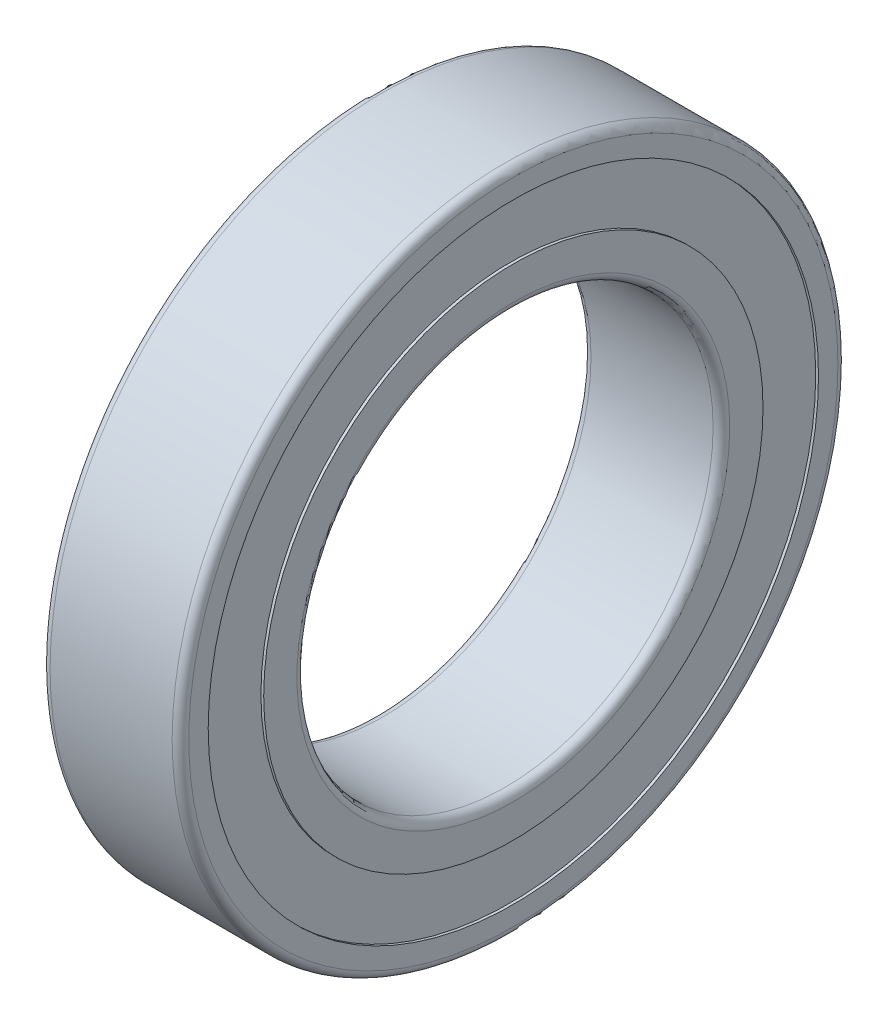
ISO-10303-21;
HEADER;
FILE_DESCRIPTION(('STEP AP214'),'2;1');
FILE_NAME('part.step','',(''),(''),'','','');
FILE_SCHEMA(('AUTOMOTIVE_DESIGN { 1 0 10303 214 1 1 1 1 }'));
ENDSEC;
DATA;
#1=APPLICATION_CONTEXT('core data for automotive mechanical design processes');
#2=APPLICATION_PROTOCOL_DEFINITION('international standard','automotive_design',2000,#1);
#3=PRODUCT_CONTEXT('',#1,'mechanical');
#4=PRODUCT('Part','Part','',(#3));
#5=PRODUCT_RELATED_PRODUCT_CATEGORY('part','',(#4));
#6=PRODUCT_DEFINITION_FORMATION('','',#4);
#7=PRODUCT_DEFINITION_CONTEXT('part definition',#1,'design');
#8=PRODUCT_DEFINITION('design','',#6,#7);
#9=PRODUCT_DEFINITION_SHAPE('','',#8);
#10=(LENGTH_UNIT() NAMED_UNIT(*) SI_UNIT(.MILLI.,.METRE.));
#11=(NAMED_UNIT(*) PLANE_ANGLE_UNIT() SI_UNIT($,.RADIAN.));
#12=(NAMED_UNIT(*) SI_UNIT($,.STERADIAN.) SOLID_ANGLE_UNIT());
#13=UNCERTAINTY_MEASURE_WITH_UNIT(LENGTH_MEASURE(1.E-05),#10,'distance_accuracy_value','');
#14=(GEOMETRIC_REPRESENTATION_CONTEXT(3) GLOBAL_UNCERTAINTY_ASSIGNED_CONTEXT((#13)) GLOBAL_UNIT_ASSIGNED_CONTEXT((#10,
#11,#12)) REPRESENTATION_CONTEXT('',''));
#15=CARTESIAN_POINT('',(0.,0.,0.));
#16=DIRECTION('',(0.,0.,1.));
#17=DIRECTION('',(1.,0.,0.));
#18=AXIS2_PLACEMENT_3D('',#15,#16,#17);
#19=CARTESIAN_POINT('',(-2.2,0.,0.));
#20=DIRECTION('',(1.,0.,0.));
#21=DIRECTION('',(0.,0.,-1.));
#22=AXIS2_PLACEMENT_3D('',#19,#20,#21);
#23=TOROIDAL_SURFACE('',#22,11.7,0.3);
#24=CARTESIAN_POINT('',(-2.2,0.,0.));
#25=DIRECTION('',(1.,0.,0.));
#26=DIRECTION('',(0.,0.,-1.));
#27=AXIS2_PLACEMENT_3D('',#24,#25,#26);
#28=CIRCLE('',#27,12.);
#29=CARTESIAN_POINT('',(-2.2,0.,-12.));
#30=VERTEX_POINT('',#29);
#31=EDGE_CURVE('E40',#30,#30,#28,.T.);
#32=ORIENTED_EDGE('',*,*,#31,.F.);
#33=EDGE_LOOP('',(#32));
#34=FACE_BOUND('',#33,.T.);
#35=CARTESIAN_POINT('',(-2.5,0.,0.));
#36=DIRECTION('',(1.,0.,0.));
#37=DIRECTION('',(0.,0.,-1.));
#38=AXIS2_PLACEMENT_3D('',#35,#36,#37);
#39=CIRCLE('',#38,11.7);
#40=CARTESIAN_POINT('',(-2.5,0.,-11.7));
#41=VERTEX_POINT('',#40);
#42=EDGE_CURVE('E11',#41,#41,#39,.T.);
#43=ORIENTED_EDGE('',*,*,#42,.T.);
#44=EDGE_LOOP('',(#43));
#45=FACE_BOUND('',#44,.T.);
#46=ADVANCED_FACE('F17',(#34,#45),#23,.T.);
#47=CARTESIAN_POINT('',(-2.5,11.7,0.));
#48=DIRECTION('',(-1.,0.,0.));
#49=DIRECTION('',(0.,0.,1.));
#50=AXIS2_PLACEMENT_3D('',#47,#48,#49);
#51=PLANE('',#50);
#52=ORIENTED_EDGE('',*,*,#42,.F.);
#53=EDGE_LOOP('',(#52));
#54=FACE_BOUND('',#53,.T.);
#55=CARTESIAN_POINT('',(-2.5,0.,0.));
#56=DIRECTION('',(1.,0.,0.));
#57=DIRECTION('',(0.,0.,-1.));
#58=AXIS2_PLACEMENT_3D('',#55,#56,#57);
#59=CIRCLE('',#58,11.);
#60=CARTESIAN_POINT('',(-2.5,0.,-11.));
#61=VERTEX_POINT('',#60);
#62=EDGE_CURVE('E28',#61,#61,#59,.T.);
#63=ORIENTED_EDGE('',*,*,#62,.T.);
#64=EDGE_LOOP('',(#63));
#65=FACE_BOUND('',#64,.T.);
#66=ADVANCED_FACE('F176',(#54,#65),#51,.T.);
#67=CARTESIAN_POINT('',(2.5,0.,0.));
#68=DIRECTION('',(-1.,0.,0.));
#69=DIRECTION('',(0.,0.,-1.));
#70=AXIS2_PLACEMENT_3D('',#67,#68,#69);
#71=CYLINDRICAL_SURFACE('',#70,11.);
#72=ORIENTED_EDGE('',*,*,#62,.F.);
#73=EDGE_LOOP('',(#72));
#74=FACE_BOUND('',#73,.T.);
#75=CARTESIAN_POINT('',(-2.4,0.,0.));
#76=DIRECTION('',(1.,0.,0.));
#77=DIRECTION('',(0.,0.,-1.));
#78=AXIS2_PLACEMENT_3D('',#75,#76,#77);
#79=CIRCLE('',#78,11.);
#80=CARTESIAN_POINT('',(-2.4,0.,-11.));
#81=VERTEX_POINT('',#80);
#82=EDGE_CURVE('E97',#81,#81,#79,.T.);
#83=ORIENTED_EDGE('',*,*,#82,.T.);
#84=EDGE_LOOP('',(#83));
#85=FACE_BOUND('',#84,.T.);
#86=ADVANCED_FACE('F181',(#74,#85),#71,.F.);
#87=CARTESIAN_POINT('',(-2.4,11.,0.));
#88=DIRECTION('',(-1.,0.,0.));
#89=DIRECTION('',(0.,0.,1.));
#90=AXIS2_PLACEMENT_3D('',#87,#88,#89);
#91=PLANE('',#90);
#92=ORIENTED_EDGE('',*,*,#82,.F.);
#93=EDGE_LOOP('',(#92));
#94=FACE_BOUND('',#93,.T.);
#95=CARTESIAN_POINT('',(-2.4,0.,0.));
#96=DIRECTION('',(1.,0.,0.));
#97=DIRECTION('',(0.,0.,-1.));
#98=AXIS2_PLACEMENT_3D('',#95,#96,#97);
#99=CIRCLE('',#98,9.);
#100=CARTESIAN_POINT('',(-2.4,0.,-9.));
#101=VERTEX_POINT('',#100);
#102=EDGE_CURVE('E102',#101,#101,#99,.T.);
#103=ORIENTED_EDGE('',*,*,#102,.T.);
#104=EDGE_LOOP('',(#103));
#105=FACE_BOUND('',#104,.T.);
#106=ADVANCED_FACE('F98',(#94,#105),#91,.T.);
#107=CARTESIAN_POINT('',(2.5,0.,0.));
#108=DIRECTION('',(-1.,0.,0.));
#109=DIRECTION('',(0.,0.,-1.));
#110=AXIS2_PLACEMENT_3D('',#107,#108,#109);
#111=CYLINDRICAL_SURFACE('',#110,9.);
#112=ORIENTED_EDGE('',*,*,#102,.F.);
#113=EDGE_LOOP('',(#112));
#114=FACE_BOUND('',#113,.T.);
#115=CARTESIAN_POINT('',(-2.5,0.,0.));
#116=DIRECTION('',(1.,0.,0.));
#117=DIRECTION('',(0.,0.,-1.));
#118=AXIS2_PLACEMENT_3D('',#115,#116,#117);
#119=CIRCLE('',#118,9.);
#120=CARTESIAN_POINT('',(-2.5,0.,-9.));
#121=VERTEX_POINT('',#120);
#122=EDGE_CURVE('E111',#121,#121,#119,.T.);
#123=ORIENTED_EDGE('',*,*,#122,.T.);
#124=EDGE_LOOP('',(#123));
#125=FACE_BOUND('',#124,.T.);
#126=ADVANCED_FACE('F186',(#114,#125),#111,.T.);
#127=CARTESIAN_POINT('',(-2.5,9.,0.));
#128=DIRECTION('',(-1.,0.,0.));
#129=DIRECTION('',(0.,0.,1.));
#130=AXIS2_PLACEMENT_3D('',#127,#128,#129);
#131=PLANE('',#130);
#132=ORIENTED_EDGE('',*,*,#122,.F.);
#133=EDGE_LOOP('',(#132));
#134=FACE_BOUND('',#133,.T.);
#135=CARTESIAN_POINT('',(-2.5,0.,0.));
#136=DIRECTION('',(1.,0.,0.));
#137=DIRECTION('',(0.,0.,-1.));
#138=AXIS2_PLACEMENT_3D('',#135,#136,#137);
#139=CIRCLE('',#138,7.8);
#140=CARTESIAN_POINT('',(-2.5,0.,-7.8));
#141=VERTEX_POINT('',#140);
#142=EDGE_CURVE('E125',#141,#141,#139,.T.);
#143=ORIENTED_EDGE('',*,*,#142,.T.);
#144=EDGE_LOOP('',(#143));
#145=FACE_BOUND('',#144,.T.);
#146=ADVANCED_FACE('F198',(#134,#145),#131,.T.);
#147=CARTESIAN_POINT('',(-2.2,0.,0.));
#148=DIRECTION('',(1.,0.,0.));
#149=DIRECTION('',(0.,0.,-1.));
#150=AXIS2_PLACEMENT_3D('',#147,#148,#149);
#151=TOROIDAL_SURFACE('',#150,7.8,0.3);
#152=ORIENTED_EDGE('',*,*,#142,.F.);
#153=EDGE_LOOP('',(#152));
#154=FACE_BOUND('',#153,.T.);
#155=CARTESIAN_POINT('',(-2.2,0.,0.));
#156=DIRECTION('',(1.,0.,0.));
#157=DIRECTION('',(0.,0.,-1.));
#158=AXIS2_PLACEMENT_3D('',#155,#156,#157);
#159=CIRCLE('',#158,7.5);
#160=CARTESIAN_POINT('',(-2.2,0.,-7.5));
#161=VERTEX_POINT('',#160);
#162=EDGE_CURVE('E122',#161,#161,#159,.T.);
#163=ORIENTED_EDGE('',*,*,#162,.T.);
#164=EDGE_LOOP('',(#163));
#165=FACE_BOUND('',#164,.T.);
#166=ADVANCED_FACE('F19',(#154,#165),#151,.T.);
#167=CARTESIAN_POINT('',(2.5,0.,0.));
#168=DIRECTION('',(-1.,0.,0.));
#169=DIRECTION('',(0.,0.,-1.));
#170=AXIS2_PLACEMENT_3D('',#167,#168,#169);
#171=CYLINDRICAL_SURFACE('',#170,7.5);
#172=ORIENTED_EDGE('',*,*,#162,.F.);
#173=EDGE_LOOP('',(#172));
#174=FACE_BOUND('',#173,.T.);
#175=CARTESIAN_POINT('',(2.2,0.,0.));
#176=DIRECTION('',(1.,0.,0.));
#177=DIRECTION('',(0.,0.,-1.));
#178=AXIS2_PLACEMENT_3D('',#175,#176,#177);
#179=CIRCLE('',#178,7.5);
#180=CARTESIAN_POINT('',(2.2,0.,-7.5));
#181=VERTEX_POINT('',#180);
#182=EDGE_CURVE('E117',#181,#181,#179,.T.);
#183=ORIENTED_EDGE('',*,*,#182,.T.);
#184=EDGE_LOOP('',(#183));
#185=FACE_BOUND('',#184,.T.);
#186=ADVANCED_FACE('F216',(#174,#185),#171,.F.);
#187=CARTESIAN_POINT('',(2.2,0.,0.));
#188=DIRECTION('',(1.,0.,0.));
#189=DIRECTION('',(0.,0.,-1.));
#190=AXIS2_PLACEMENT_3D('',#187,#188,#189);
#191=TOROIDAL_SURFACE('',#190,7.8,0.3);
#192=ORIENTED_EDGE('',*,*,#182,.F.);
#193=EDGE_LOOP('',(#192));
#194=FACE_BOUND('',#193,.T.);
#195=CARTESIAN_POINT('',(2.5,0.,0.));
#196=DIRECTION('',(1.,0.,0.));
#197=DIRECTION('',(0.,0.,-1.));
#198=AXIS2_PLACEMENT_3D('',#195,#196,#197);
#199=CIRCLE('',#198,7.80000000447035);
#200=CARTESIAN_POINT('',(2.5,0.,-7.80000000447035));
#201=VERTEX_POINT('',#200);
#202=EDGE_CURVE('E114',#201,#201,#199,.T.);
#203=ORIENTED_EDGE('',*,*,#202,.T.);
#204=EDGE_LOOP('',(#203));
#205=FACE_BOUND('',#204,.T.);
#206=ADVANCED_FACE('F209',(#194,#205),#191,.T.);
#207=CARTESIAN_POINT('',(2.5,7.8,0.));
#208=DIRECTION('',(1.,0.,0.));
#209=DIRECTION('',(0.,1.,0.));
#210=AXIS2_PLACEMENT_3D('',#207,#208,#209);
#211=PLANE('',#210);
#212=CARTESIAN_POINT('',(2.5,0.,0.));
#213=DIRECTION('',(1.,0.,0.));
#214=DIRECTION('',(0.,0.,-1.));
#215=AXIS2_PLACEMENT_3D('',#212,#213,#214);
#216=CIRCLE('',#215,9.);
#217=CARTESIAN_POINT('',(2.5,0.,-9.));
#218=VERTEX_POINT('',#217);
#219=EDGE_CURVE('E118',#218,#218,#216,.T.);
#220=ORIENTED_EDGE('',*,*,#219,.T.);
#221=EDGE_LOOP('',(#220));
#222=FACE_BOUND('',#221,.T.);
#223=ORIENTED_EDGE('',*,*,#202,.F.);
#224=EDGE_LOOP('',(#223));
#225=FACE_BOUND('',#224,.T.);
#226=ADVANCED_FACE('F205',(#222,#225),#211,.T.);
#227=CARTESIAN_POINT('',(2.5,0.,0.));
#228=DIRECTION('',(-1.,0.,0.));
#229=DIRECTION('',(0.,0.,-1.));
#230=AXIS2_PLACEMENT_3D('',#227,#228,#229);
#231=CYLINDRICAL_SURFACE('',#230,9.);
#232=ORIENTED_EDGE('',*,*,#219,.F.);
#233=EDGE_LOOP('',(#232));
#234=FACE_BOUND('',#233,.T.);
#235=CARTESIAN_POINT('',(2.4,0.,0.));
#236=DIRECTION('',(1.,0.,0.));
#237=DIRECTION('',(0.,0.,-1.));
#238=AXIS2_PLACEMENT_3D('',#235,#236,#237);
#239=CIRCLE('',#238,9.);
#240=CARTESIAN_POINT('',(2.4,0.,-9.));
#241=VERTEX_POINT('',#240);
#242=EDGE_CURVE('E119',#241,#241,#239,.T.);
#243=ORIENTED_EDGE('',*,*,#242,.T.);
#244=EDGE_LOOP('',(#243));
#245=FACE_BOUND('',#244,.T.);
#246=ADVANCED_FACE('F202',(#234,#245),#231,.T.);
#247=CARTESIAN_POINT('',(2.4,9.,0.));
#248=DIRECTION('',(1.,0.,0.));
#249=DIRECTION('',(0.,1.,0.));
#250=AXIS2_PLACEMENT_3D('',#247,#248,#249);
#251=PLANE('',#250);
#252=CARTESIAN_POINT('',(2.4,0.,0.));
#253=DIRECTION('',(1.,0.,0.));
#254=DIRECTION('',(0.,0.,-1.));
#255=AXIS2_PLACEMENT_3D('',#252,#253,#254);
#256=CIRCLE('',#255,11.);
#257=CARTESIAN_POINT('',(2.4,0.,-11.));
#258=VERTEX_POINT('',#257);
#259=EDGE_CURVE('E21',#258,#258,#256,.T.);
#260=ORIENTED_EDGE('',*,*,#259,.T.);
#261=EDGE_LOOP('',(#260));
#262=FACE_BOUND('',#261,.T.);
#263=ORIENTED_EDGE('',*,*,#242,.F.);
#264=EDGE_LOOP('',(#263));
#265=FACE_BOUND('',#264,.T.);
#266=ADVANCED_FACE('F194',(#262,#265),#251,.T.);
#267=CARTESIAN_POINT('',(2.5,0.,0.));
#268=DIRECTION('',(-1.,0.,0.));
#269=DIRECTION('',(0.,0.,-1.));
#270=AXIS2_PLACEMENT_3D('',#267,#268,#269);
#271=CYLINDRICAL_SURFACE('',#270,11.);
#272=ORIENTED_EDGE('',*,*,#259,.F.);
#273=EDGE_LOOP('',(#272));
#274=FACE_BOUND('',#273,.T.);
#275=CARTESIAN_POINT('',(2.5,0.,0.));
#276=DIRECTION('',(1.,0.,0.));
#277=DIRECTION('',(0.,0.,-1.));
#278=AXIS2_PLACEMENT_3D('',#275,#276,#277);
#279=CIRCLE('',#278,11.);
#280=CARTESIAN_POINT('',(2.5,0.,-11.));
#281=VERTEX_POINT('',#280);
#282=EDGE_CURVE('E146',#281,#281,#279,.T.);
#283=ORIENTED_EDGE('',*,*,#282,.T.);
#284=EDGE_LOOP('',(#283));
#285=FACE_BOUND('',#284,.T.);
#286=ADVANCED_FACE('F191',(#274,#285),#271,.F.);
#287=CARTESIAN_POINT('',(2.5,11.,0.));
#288=DIRECTION('',(1.,0.,0.));
#289=DIRECTION('',(0.,1.,0.));
#290=AXIS2_PLACEMENT_3D('',#287,#288,#289);
#291=PLANE('',#290);
#292=CARTESIAN_POINT('',(2.5,0.,0.));
#293=DIRECTION('',(1.,0.,0.));
#294=DIRECTION('',(0.,0.,-1.));
#295=AXIS2_PLACEMENT_3D('',#292,#293,#294);
#296=CIRCLE('',#295,11.7);
#297=CARTESIAN_POINT('',(2.5,0.,-11.7));
#298=VERTEX_POINT('',#297);
#299=EDGE_CURVE('E150',#298,#298,#296,.T.);
#300=ORIENTED_EDGE('',*,*,#299,.T.);
#301=EDGE_LOOP('',(#300));
#302=FACE_BOUND('',#301,.T.);
#303=ORIENTED_EDGE('',*,*,#282,.F.);
#304=EDGE_LOOP('',(#303));
#305=FACE_BOUND('',#304,.T.);
#306=ADVANCED_FACE('F171',(#302,#305),#291,.T.);
#307=CARTESIAN_POINT('',(2.2,0.,0.));
#308=DIRECTION('',(1.,0.,0.));
#309=DIRECTION('',(0.,0.,-1.));
#310=AXIS2_PLACEMENT_3D('',#307,#308,#309);
#311=TOROIDAL_SURFACE('',#310,11.7,0.3);
#312=ORIENTED_EDGE('',*,*,#299,.F.);
#313=EDGE_LOOP('',(#312));
#314=FACE_BOUND('',#313,.T.);
#315=CARTESIAN_POINT('',(2.2,0.,0.));
#316=DIRECTION('',(1.,0.,0.));
#317=DIRECTION('',(0.,0.,-1.));
#318=AXIS2_PLACEMENT_3D('',#315,#316,#317);
#319=CIRCLE('',#318,12.);
#320=CARTESIAN_POINT('',(2.2,0.,-12.));
#321=VERTEX_POINT('',#320);
#322=EDGE_CURVE('E141',#321,#321,#319,.T.);
#323=ORIENTED_EDGE('',*,*,#322,.T.);
#324=EDGE_LOOP('',(#323));
#325=FACE_BOUND('',#324,.T.);
#326=ADVANCED_FACE('F161',(#314,#325),#311,.T.);
#327=CARTESIAN_POINT('',(2.5,0.,0.));
#328=DIRECTION('',(-1.,0.,0.));
#329=DIRECTION('',(0.,0.,-1.));
#330=AXIS2_PLACEMENT_3D('',#327,#328,#329);
#331=CYLINDRICAL_SURFACE('',#330,12.);
#332=ORIENTED_EDGE('',*,*,#322,.F.);
#333=EDGE_LOOP('',(#332));
#334=FACE_BOUND('',#333,.T.);
#335=ORIENTED_EDGE('',*,*,#31,.T.);
#336=EDGE_LOOP('',(#335));
#337=FACE_BOUND('',#336,.T.);
#338=ADVANCED_FACE('F163',(#334,#337),#331,.T.);
#339=CLOSED_SHELL('',(#46,#66,#86,#106,#126,#146,#166,#186,#206,#226,#246,#266,#286,#306,#326,#338));
#340=MANIFOLD_SOLID_BREP('B1',#339);
#341=ADVANCED_BREP_SHAPE_REPRESENTATION('',(#18,#340),#14);
#342=SHAPE_DEFINITION_REPRESENTATION(#9,#341);
ENDSEC;
END-ISO-10303-21;
